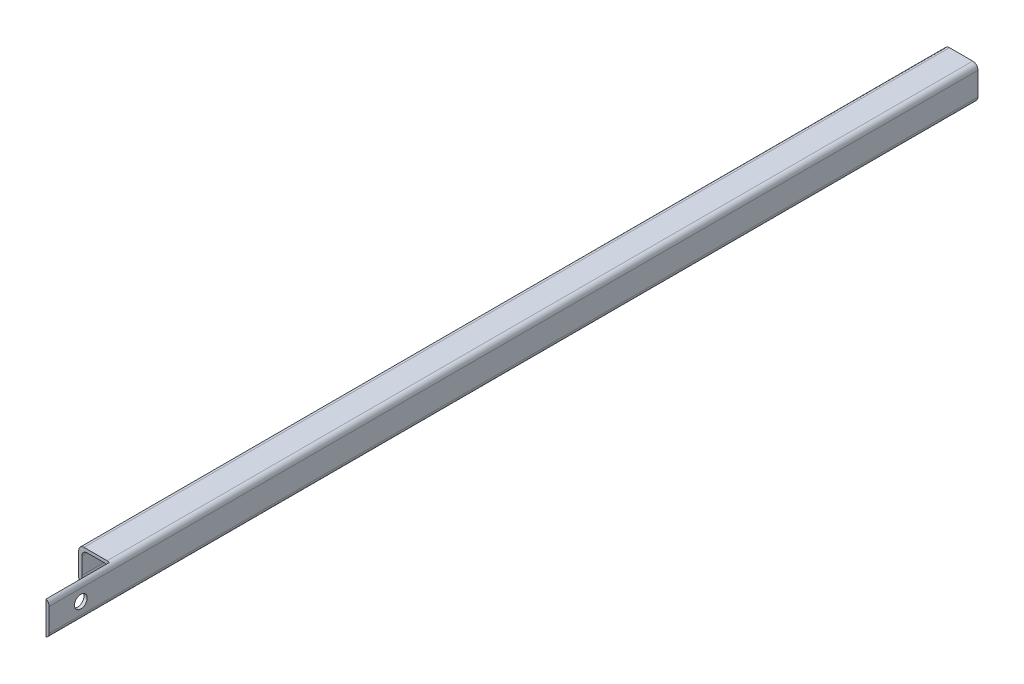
from build123d import *

# Parameters (mm, degrees)
BASE_EXTRUSION_DEPTH         = 440
ENL_V_MAT_EXTRU_1_DEPTH      = 441.145430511
ENL_V_MAT_EXTRU_1_DEPTH_BACK = 441.145430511
ESQUISSE2_W                  = 14.5
ESQUISSE2_H                  = 30
ESQUISSE3_R                  = 3
ENL_V_MAT_EXTRU_3_DEPTH      = 441.145430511


with BuildPart() as part:
    # Esquisse1 → Base-Extrusion (new body)
    with BuildSketch(Plane.XY):
        with BuildLine():
            Line((-5.5, 8), (5.5, 8))
            ThreePointArc((5.5, 8), (7.267766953, 7.267766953), (8, 5.5))
            Line((8, 5.5), (8, -5.5))
            ThreePointArc((8, -5.5), (7.267766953, -7.267766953), (5.5, -8))
            Line((5.5, -8), (-5.5, -8))
            ThreePointArc((-5.5, -8), (-7.267766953, -7.267766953), (-8, -5.5))
            Line((-8, -5.5), (-8, 5.5))
            ThreePointArc((-8, 5.5), (-7.267766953, 7.267766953), (-5.5, 8))
        make_face()
        with BuildLine():
            Line((-4, 6.5), (4, 6.5))
            ThreePointArc((4, 6.5), (5.767766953, 5.767766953), (6.5, 4))
            Line((6.5, 4), (6.5, -4))
            ThreePointArc((6.5, -4), (5.767766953, -5.767766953), (4, -6.5))
            Line((4, -6.5), (-4, -6.5))
            ThreePointArc((-4, -6.5), (-5.767766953, -5.767766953), (-6.5, -4))
            Line((-6.5, -4), (-6.5, 4))
            ThreePointArc((-6.5, 4), (-5.767766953, 5.767766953), (-4, 6.5))
        make_face(mode=Mode.SUBTRACT)
    extrude(amount=BASE_EXTRUSION_DEPTH)

    # Esquisse2 → Enl_v. mat.-Extru.1 (cut, two sides: drawn at the far end of the back side and taken through both)
    with BuildSketch(Plane(origin=(0, 0, 0), x_dir=(1, 0, 0), z_dir=(0, 1, 0)).offset(-ENL_V_MAT_EXTRU_1_DEPTH_BACK)):
        with Locations((-0.75, -425)):
            Rectangle(ESQUISSE2_W, ESQUISSE2_H)
    extrude(amount=ENL_V_MAT_EXTRU_1_DEPTH + ENL_V_MAT_EXTRU_1_DEPTH_BACK, mode=Mode.SUBTRACT)

    # Esquisse3 → Enl_v. mat.-Extru.3 (cut, through all)
    with BuildSketch(Plane(origin=(0, 0, 0), x_dir=(0, 0, -1), z_dir=(1, 0, 0))):
        with Locations(Location((-425, 0, 0), (0, 0, 180))):
            Circle(ESQUISSE3_R)
    extrude(amount=ENL_V_MAT_EXTRU_3_DEPTH, mode=Mode.SUBTRACT)


solid = part.part
